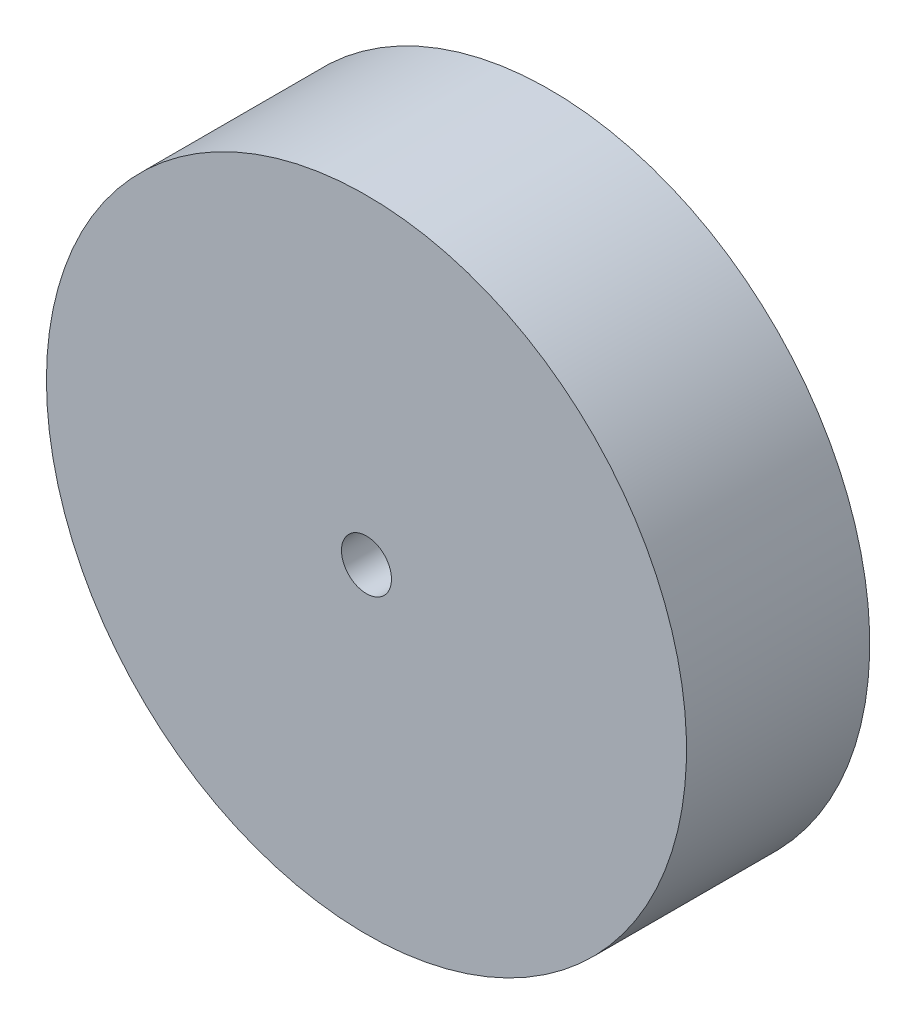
from build123d import *

# Parameters (mm, degrees)
SKETCH1_R      = 50.8
EXTRUDE1_DEPTH = 29.083
SKETCH2_R      = 3.96875
EXTRUDE2_DEPTH = 29.083


with BuildPart() as part:
    # Sketch1 → Extrude1 (new body)
    with BuildSketch(Plane.XY):
        with Locations(Location((0, 0, 0), (0, 0, 180))):
            Circle(SKETCH1_R)
    extrude(amount=EXTRUDE1_DEPTH)

    # Sketch2 → Extrude2 (cut)
    with BuildSketch(Plane(origin=(0, 0, 0), x_dir=(-1, 0, 0), z_dir=(0, 0, -1))):
        Circle(SKETCH2_R)
    extrude(amount=-EXTRUDE2_DEPTH, mode=Mode.SUBTRACT)


solid = part.part
